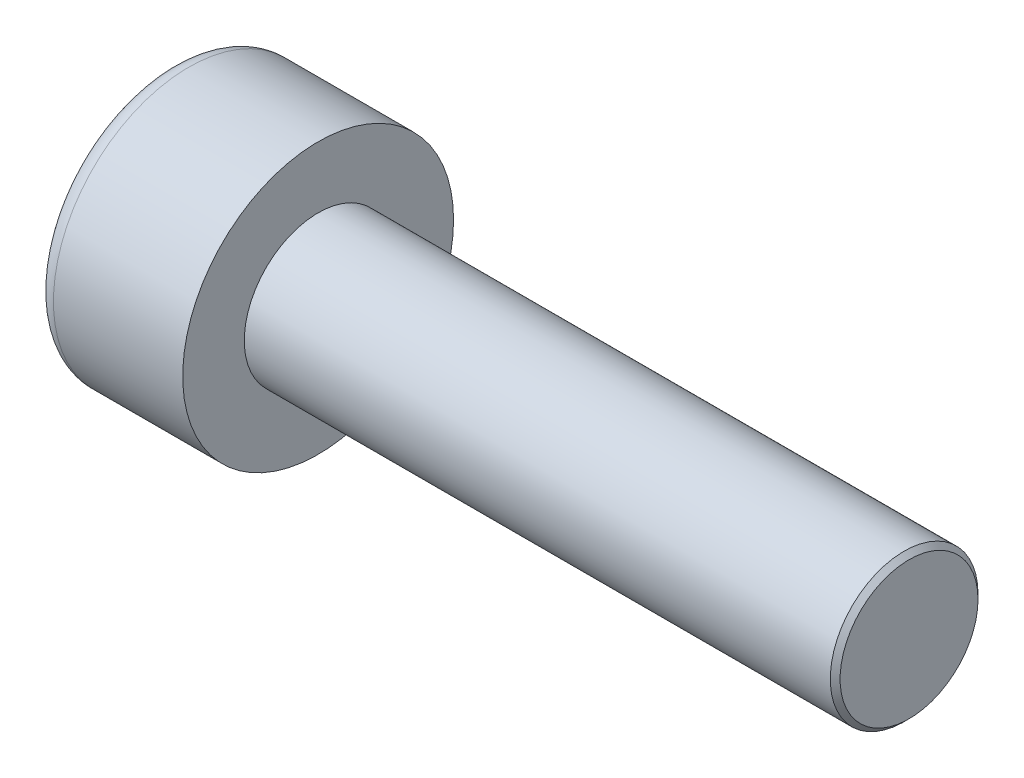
from build123d import *

# Parameters (mm, degrees)
SKETCH1_R           = 2.75
BASEHEAD_DEPTH      = 3
SKETCH2_R           = 1.5
BASEBODY_DEPTH      = 12
HEXAGONSOCKET_DEPTH = 1.3
TOPFILLET_R         = 0.375
CHAMFER1_SIZE       = 0.1


with BuildPart() as part:
    # Sketch1 → BaseHead (new body)
    with BuildSketch(Plane(origin=(0, 0, 0), x_dir=(0, 0, -1), z_dir=(1, 0, 0))):
        Circle(SKETCH1_R)
    extrude(amount=BASEHEAD_DEPTH)

    # Sketch2 → BaseBody (add)
    with BuildSketch(Plane(origin=(3, 0, 0), x_dir=(0, 0, -1), z_dir=(1, 0, 0))):
        Circle(SKETCH2_R)
    extrude(amount=BASEBODY_DEPTH)

    # Sketch3 → HexagonSocket (cut)
    with BuildSketch(Plane(origin=(0, 0, 0), x_dir=(0, 0, -1), z_dir=(1, 0, 0))):
        Polygon((1.443375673, 0), (0.721687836, 1.25), (-0.721687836, 1.25), (-1.443375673, 0), (-0.721687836, -1.25), (0.721687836, -1.25), align=None)
    extrude(amount=HEXAGONSOCKET_DEPTH, mode=Mode.SUBTRACT)

    # Sketch4 → Cut-Revolve1 (revolve, cut)
    with BuildSketch(Plane(origin=(-4.19613823, 0.75, 0), x_dir=(-1, 0, 0), z_dir=(0, 0, 1)), mode=Mode.PRIVATE) as cut_revolve1_sk:
        Polygon((-5.49613823, 2), (-6.217826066, 0.75), (-5.49613823, 0.75), align=None)
    revolve(cut_revolve1_sk.sketch.rotate(Axis((0.838992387, 0, 0), (-1, 0, 0)), 90), axis=Axis((0.838992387, 0, 0), (-1, 0, 0)), mode=Mode.SUBTRACT)

    # TopFillet
    topfillet_edges = [part.edges().sort_by_distance(p)[0] for p in [
        (0, 0, 2.75),
    ]]
    fillet(topfillet_edges, radius=TOPFILLET_R)

    # Chamfer1
    chamfer1_edges = [part.edges().sort_by_distance(p)[0] for p in [
        (15, 0, 1.5),
    ]]
    chamfer(chamfer1_edges, length=CHAMFER1_SIZE)


solid = part.part
